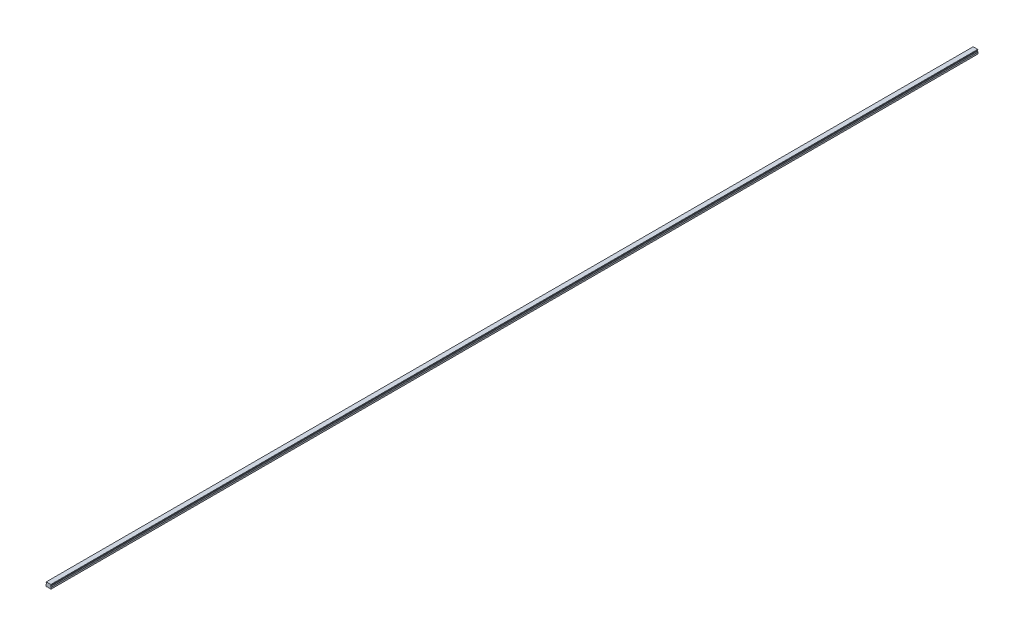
from build123d import *

# Parameters (mm, degrees)
SKETCH1_W           = 20
SKETCH1_H           = 16.3
BOSS_EXTRUDE1_DEPTH = 1820
CUT_EXTRUDE1_DEPTH  = 3641.050231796
CHAMFER1_SIZE       = 1
FILLET1_R           = 1
CUT_EXTRUDE2_DEPTH  = 3641.050231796
SKETCH5_R           = 3
SKETCH5_R_2         = 2.5
CUT_EXTRUDE5_DEPTH  = 10
SKETCH5_2_R         = 2.5
CUT_EXTRUDE6_DEPTH  = 13
LPATTERN2_COUNT     = 61
LPATTERN2_PITCH     = 60


with BuildPart() as part:
    # Sketch1 → Boss-Extrude1 (new, symmetric)
    with BuildSketch(Plane.XY):
        with Locations((0, 8.15)):
            Rectangle(SKETCH1_W, SKETCH1_H)
    extrude(amount=BOSS_EXTRUDE1_DEPTH, both=True)

    # Sketch2 → Cut-Extrude1 (cut, through all)
    with BuildSketch(Plane.XY.offset(1820)):
        Polygon((-10, 14.3), (-10, 7.3), (-7.666666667, 9.633333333), (-7.666666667, 11.966666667), align=None)
        Polygon((7.666666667, 11.966666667), (10, 14.3), (10, 7.3), (7.666666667, 9.633333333), align=None)
    extrude(amount=-CUT_EXTRUDE1_DEPTH, mode=Mode.SUBTRACT)

    # Chamfer1
    chamfer1_edges = [part.edges().sort_by_distance(p)[0] for p in [
        (-10, 16.3, 0),
        (10, 16.3, 0),
        (10, 0, 0),
        (-10, 0, 0),
    ]]
    chamfer(chamfer1_edges, length=CHAMFER1_SIZE)

    # Fillet1
    fillet1_edges = [part.edges().sort_by_distance(p)[0] for p in [
        (-7.666666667, 11.966666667, 0),
        (-7.666666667, 9.633333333, 0),
        (7.666666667, 9.633333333, 0),
        (7.666666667, 11.966666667, 0),
    ]]
    fillet(fillet1_edges, radius=FILLET1_R)

    # Sketch3 → Cut-Extrude2 (cut, through all)
    with BuildSketch(Plane.XY.offset(1820)):
        Polygon((-6, 0), (-5, 1), (5, 1), (6, 0), align=None)
    extrude(amount=-CUT_EXTRUDE2_DEPTH, mode=Mode.SUBTRACT)

    # Sketch5 → Cut-Extrude5 (cut)
    with BuildSketch(Plane.XZ.offset(-1)):
        with Locations(Location((0, 1800, 0), (0, 0, 270))):
            Circle(SKETCH5_R)
        with Locations(Location((0, 1800, 0), (0, 0, 270))):
            Circle(SKETCH5_R_2, mode=Mode.SUBTRACT)
    cut_extrude5 = extrude(amount=-CUT_EXTRUDE5_DEPTH, mode=Mode.SUBTRACT)

    # Sketch5_2 → Cut-Extrude6 (cut)
    with BuildSketch(Plane.XZ.offset(-1)):
        with Locations(Location((0, 1800, 0), (0, 0, 270))):
            Circle(SKETCH5_2_R)
    cut_extrude6 = extrude(amount=-CUT_EXTRUDE6_DEPTH, mode=Mode.SUBTRACT)

    # Cut-Extrude7 cone 1 section (on through the dimple's axis) → Cut-Extrude7 (revolve, cut)
    with BuildSketch(Plane(origin=(0, 14, 1800), x_dir=(0, 0, -1), z_dir=(1, 0, 0))):
        Polygon((0, 0), (2.5, 0), (0, 1.443375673), align=None)
    cut_extrude7 = revolve(axis=Axis((0, 14, 1800), (0, 1, 0)), mode=Mode.SUBTRACT)

    # LPattern2: Cut-Extrude5, Cut-Extrude6, Cut-Extrude7 ×61
    with Locations(*[(0, 0, -i * LPATTERN2_PITCH) for i in range(1, LPATTERN2_COUNT)]):
        add(cut_extrude5, mode=Mode.SUBTRACT)
        add(cut_extrude6, mode=Mode.SUBTRACT)
        add(cut_extrude7, mode=Mode.SUBTRACT)


solid = part.part
